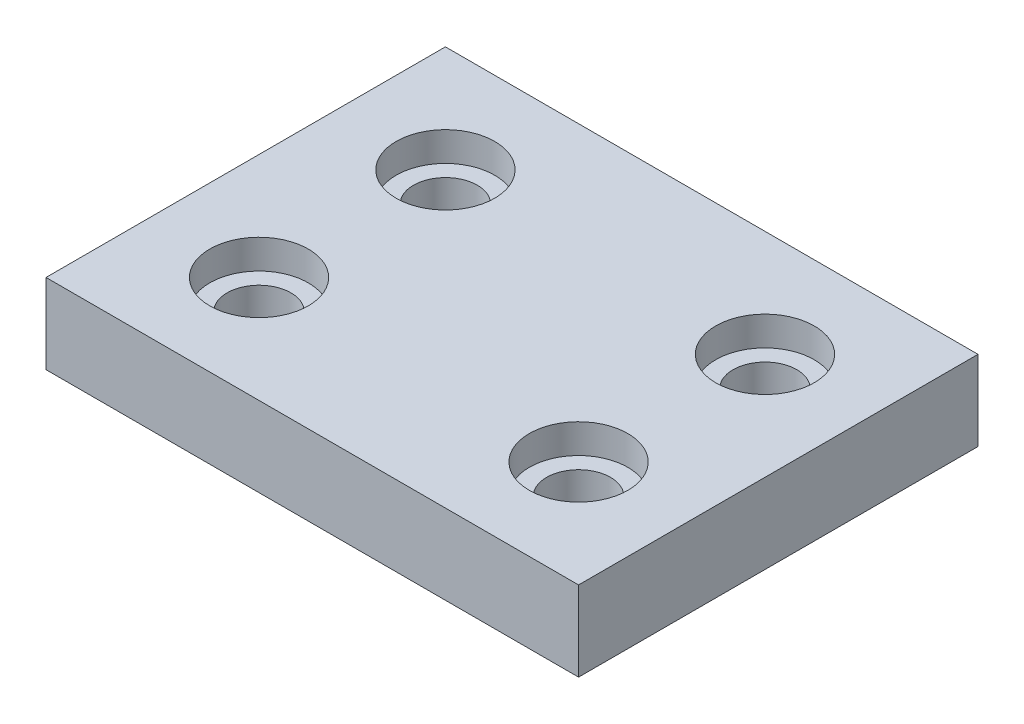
from build123d import *

# Parameters (mm, degrees)
SKETCH1_W                        = 100
SKETCH1_H                        = 75
BOSS_EXTRUDE1_DEPTH              = 15
CBORE_FOR_M10_SBHCS1_D           = 12
CBORE_FOR_M10_SBHCS1_CBORE_D     = 18.5
CBORE_FOR_M10_SBHCS1_CBORE_DEPTH = 5.5


with BuildPart() as part:
    # Sketch1 → Boss-Extrude1 (new body)
    with BuildSketch(Plane(origin=(0, 0, 0), x_dir=(1, 0, 0), z_dir=(0, 1, 0))):
        Rectangle(SKETCH1_W, SKETCH1_H)
    extrude(amount=BOSS_EXTRUDE1_DEPTH)

    # CBORE for M10 SBHCS1 (through all)
    with Locations(Plane(origin=(0, 15, 0), x_dir=(-1, 0, 0), z_dir=(0, 1, 0))):
        with Locations((30, 17.5), (30, -17.5), (-30, -17.5), (-30, 17.5)):
            CounterBoreHole(CBORE_FOR_M10_SBHCS1_D / 2, CBORE_FOR_M10_SBHCS1_CBORE_D / 2, CBORE_FOR_M10_SBHCS1_CBORE_DEPTH)


solid = part.part
